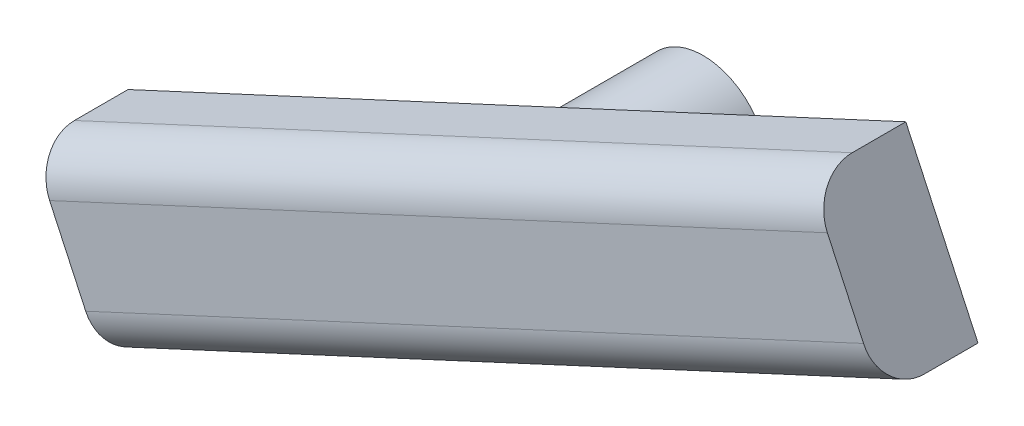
from build123d import *

# Parameters (mm, degrees)
VASTAGO_PROFILE_R = 3
GOMA_START        = -15
GOMA_DEPTH        = 4.5
REDONDEO1_R       = 2


with BuildPart() as part:
    # Vastago: sweep along a curve in space
    with BuildLine() as vastago_path:
        Line((455.341566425, 345.362620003, -22), (455.341566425, 345.362620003, -15))
    # Vastago profile (on start of the path) → Vastago (sweep)
    with BuildSketch(Plane(origin=(455.341566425, 345.362620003, -22), x_dir=(1, 0, 0), z_dir=(0, 0, 1))):
        Circle(VASTAGO_PROFILE_R)
    sweep(path=vastago_path.line)

    # Sk_Goma → Goma (add)
    with BuildSketch(Plane.XY.offset(GOMA_START)):
        Polygon((438.883933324, 333.314951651), (435.516186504, 340.571554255), (471.799199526, 357.410288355), (475.166946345, 350.15368575), align=None)
    extrude(amount=GOMA_DEPTH)

    # Redondeo1
    redondeo1_edges = [part.edges().sort_by_distance(p)[0] for p in [
        (457.025439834, 341.734318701, -10.5),
        (453.657693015, 348.990921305, -10.5),
    ]]
    fillet(redondeo1_edges, radius=REDONDEO1_R)


solid = part.part
